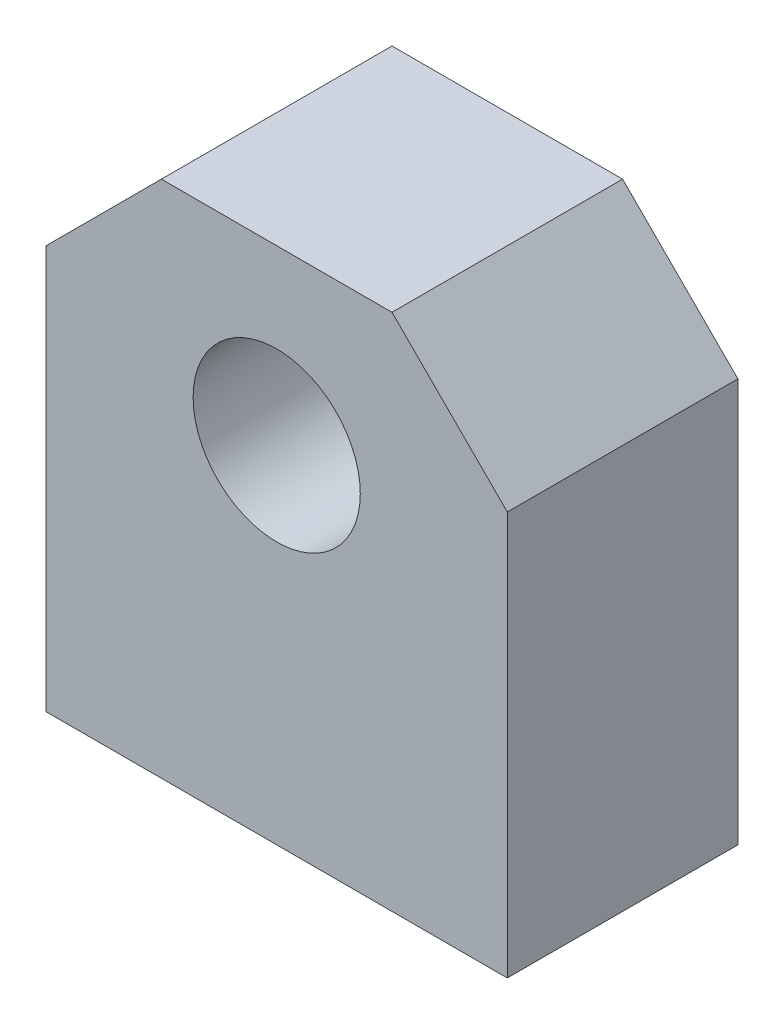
ISO-10303-21;
HEADER;
FILE_DESCRIPTION(('STEP AP214'),'2;1');
FILE_NAME('part.step','',(''),(''),'','','');
FILE_SCHEMA(('AUTOMOTIVE_DESIGN { 1 0 10303 214 1 1 1 1 }'));
ENDSEC;
DATA;
#1=APPLICATION_CONTEXT('core data for automotive mechanical design processes');
#2=APPLICATION_PROTOCOL_DEFINITION('international standard','automotive_design',2000,#1);
#3=PRODUCT_CONTEXT('',#1,'mechanical');
#4=PRODUCT('Part','Part','',(#3));
#5=PRODUCT_RELATED_PRODUCT_CATEGORY('part','',(#4));
#6=PRODUCT_DEFINITION_FORMATION('','',#4);
#7=PRODUCT_DEFINITION_CONTEXT('part definition',#1,'design');
#8=PRODUCT_DEFINITION('design','',#6,#7);
#9=PRODUCT_DEFINITION_SHAPE('','',#8);
#10=(LENGTH_UNIT() NAMED_UNIT(*) SI_UNIT(.MILLI.,.METRE.));
#11=(NAMED_UNIT(*) PLANE_ANGLE_UNIT() SI_UNIT($,.RADIAN.));
#12=(NAMED_UNIT(*) SI_UNIT($,.STERADIAN.) SOLID_ANGLE_UNIT());
#13=UNCERTAINTY_MEASURE_WITH_UNIT(LENGTH_MEASURE(1.E-05),#10,'distance_accuracy_value','');
#14=(GEOMETRIC_REPRESENTATION_CONTEXT(3) GLOBAL_UNCERTAINTY_ASSIGNED_CONTEXT((#13)) GLOBAL_UNIT_ASSIGNED_CONTEXT((#10,
#11,#12)) REPRESENTATION_CONTEXT('',''));
#15=CARTESIAN_POINT('',(0.,0.,0.));
#16=DIRECTION('',(0.,0.,1.));
#17=DIRECTION('',(1.,0.,0.));
#18=AXIS2_PLACEMENT_3D('',#15,#16,#17);
#19=CARTESIAN_POINT('',(-20.,15.,20.));
#20=DIRECTION('',(0.,0.,-1.));
#21=DIRECTION('',(-1.,0.,0.));
#22=AXIS2_PLACEMENT_3D('',#19,#20,#21);
#23=PLANE('',#22);
#24=DIRECTION('',(0.,-1.,0.));
#25=VECTOR('',#24,1.);
#26=CARTESIAN_POINT('',(-20.,-30.,20.));
#27=LINE('',#26,#25);
#28=CARTESIAN_POINT('',(-20.,5.,20.));
#29=VERTEX_POINT('',#28);
#30=CARTESIAN_POINT('',(-20.,-30.,20.));
#31=VERTEX_POINT('',#30);
#32=EDGE_CURVE('E137',#29,#31,#27,.T.);
#33=ORIENTED_EDGE('',*,*,#32,.T.);
#34=DIRECTION('',(1.,0.,0.));
#35=VECTOR('',#34,1.);
#36=CARTESIAN_POINT('',(-20.,-30.,20.));
#37=LINE('',#36,#35);
#38=CARTESIAN_POINT('',(20.,-30.,20.));
#39=VERTEX_POINT('',#38);
#40=EDGE_CURVE('E93',#31,#39,#37,.T.);
#41=ORIENTED_EDGE('',*,*,#40,.T.);
#42=DIRECTION('',(0.,1.,0.));
#43=VECTOR('',#42,1.);
#44=CARTESIAN_POINT('',(20.,-30.,20.));
#45=LINE('',#44,#43);
#46=CARTESIAN_POINT('',(20.,5.,20.));
#47=VERTEX_POINT('',#46);
#48=EDGE_CURVE('E108',#39,#47,#45,.T.);
#49=ORIENTED_EDGE('',*,*,#48,.T.);
#50=DIRECTION('',(-0.707106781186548,0.707106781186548,0.));
#51=VECTOR('',#50,1.);
#52=CARTESIAN_POINT('',(10.,15.,20.));
#53=LINE('',#52,#51);
#54=CARTESIAN_POINT('',(10.,15.,20.));
#55=VERTEX_POINT('',#54);
#56=EDGE_CURVE('E102',#47,#55,#53,.T.);
#57=ORIENTED_EDGE('',*,*,#56,.T.);
#58=DIRECTION('',(-1.,0.,0.));
#59=VECTOR('',#58,1.);
#60=CARTESIAN_POINT('',(-10.,15.,20.));
#61=LINE('',#60,#59);
#62=CARTESIAN_POINT('',(-10.,15.,20.));
#63=VERTEX_POINT('',#62);
#64=EDGE_CURVE('E106',#55,#63,#61,.T.);
#65=ORIENTED_EDGE('',*,*,#64,.T.);
#66=DIRECTION('',(-0.707106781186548,-0.707106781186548,0.));
#67=VECTOR('',#66,1.);
#68=CARTESIAN_POINT('',(-20.,5.,20.));
#69=LINE('',#68,#67);
#70=EDGE_CURVE('E55',#63,#29,#69,.T.);
#71=ORIENTED_EDGE('',*,*,#70,.T.);
#72=EDGE_LOOP('',(#33,#41,#49,#57,#65,#71));
#73=FACE_BOUND('',#72,.T.);
#74=CARTESIAN_POINT('',(0.,0.,20.));
#75=DIRECTION('',(0.,0.,1.));
#76=DIRECTION('',(1.,0.,0.));
#77=AXIS2_PLACEMENT_3D('',#74,#75,#76);
#78=CIRCLE('',#77,7.25);
#79=CARTESIAN_POINT('',(7.25,0.,20.));
#80=VERTEX_POINT('',#79);
#81=EDGE_CURVE('E130',#80,#80,#78,.T.);
#82=ORIENTED_EDGE('',*,*,#81,.F.);
#83=EDGE_LOOP('',(#82));
#84=FACE_BOUND('',#83,.T.);
#85=ADVANCED_FACE('F38',(#73,#84),#23,.F.);
#86=CARTESIAN_POINT('',(-20.,15.,0.));
#87=DIRECTION('',(0.,0.,-1.));
#88=DIRECTION('',(-1.,0.,0.));
#89=AXIS2_PLACEMENT_3D('',#86,#87,#88);
#90=PLANE('',#89);
#91=DIRECTION('',(0.,-1.,0.));
#92=VECTOR('',#91,1.);
#93=CARTESIAN_POINT('',(-20.,-30.,0.));
#94=LINE('',#93,#92);
#95=CARTESIAN_POINT('',(-20.,5.,0.));
#96=VERTEX_POINT('',#95);
#97=CARTESIAN_POINT('',(-20.,-30.,0.));
#98=VERTEX_POINT('',#97);
#99=EDGE_CURVE('E126',#96,#98,#94,.T.);
#100=ORIENTED_EDGE('',*,*,#99,.F.);
#101=DIRECTION('',(-0.707106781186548,-0.707106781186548,0.));
#102=VECTOR('',#101,1.);
#103=CARTESIAN_POINT('',(-20.,5.,0.));
#104=LINE('',#103,#102);
#105=CARTESIAN_POINT('',(-10.,15.,0.));
#106=VERTEX_POINT('',#105);
#107=EDGE_CURVE('E85',#106,#96,#104,.T.);
#108=ORIENTED_EDGE('',*,*,#107,.F.);
#109=DIRECTION('',(-1.,0.,0.));
#110=VECTOR('',#109,1.);
#111=CARTESIAN_POINT('',(-10.,15.,0.));
#112=LINE('',#111,#110);
#113=CARTESIAN_POINT('',(10.,15.,0.));
#114=VERTEX_POINT('',#113);
#115=EDGE_CURVE('E79',#114,#106,#112,.T.);
#116=ORIENTED_EDGE('',*,*,#115,.F.);
#117=DIRECTION('',(-0.707106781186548,0.707106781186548,0.));
#118=VECTOR('',#117,1.);
#119=CARTESIAN_POINT('',(10.,15.,0.));
#120=LINE('',#119,#118);
#121=CARTESIAN_POINT('',(20.,5.,0.));
#122=VERTEX_POINT('',#121);
#123=EDGE_CURVE('E116',#122,#114,#120,.T.);
#124=ORIENTED_EDGE('',*,*,#123,.F.);
#125=DIRECTION('',(0.,1.,0.));
#126=VECTOR('',#125,1.);
#127=CARTESIAN_POINT('',(20.,-30.,0.));
#128=LINE('',#127,#126);
#129=CARTESIAN_POINT('',(20.,-30.,0.));
#130=VERTEX_POINT('',#129);
#131=EDGE_CURVE('E132',#130,#122,#128,.T.);
#132=ORIENTED_EDGE('',*,*,#131,.F.);
#133=DIRECTION('',(1.,0.,0.));
#134=VECTOR('',#133,1.);
#135=CARTESIAN_POINT('',(-20.,-30.,0.));
#136=LINE('',#135,#134);
#137=EDGE_CURVE('E129',#98,#130,#136,.T.);
#138=ORIENTED_EDGE('',*,*,#137,.F.);
#139=EDGE_LOOP('',(#100,#108,#116,#124,#132,#138));
#140=FACE_BOUND('',#139,.T.);
#141=CARTESIAN_POINT('',(0.,0.,0.));
#142=DIRECTION('',(0.,0.,1.));
#143=DIRECTION('',(1.,0.,0.));
#144=AXIS2_PLACEMENT_3D('',#141,#142,#143);
#145=CIRCLE('',#144,7.25);
#146=CARTESIAN_POINT('',(7.25,0.,0.));
#147=VERTEX_POINT('',#146);
#148=EDGE_CURVE('E203',#147,#147,#145,.T.);
#149=ORIENTED_EDGE('',*,*,#148,.T.);
#150=EDGE_LOOP('',(#149));
#151=FACE_BOUND('',#150,.T.);
#152=ADVANCED_FACE('F146',(#140,#151),#90,.T.);
#153=CARTESIAN_POINT('',(-20.,-30.,20.));
#154=DIRECTION('',(1.,0.,0.));
#155=DIRECTION('',(0.,0.,-1.));
#156=AXIS2_PLACEMENT_3D('',#153,#154,#155);
#157=PLANE('',#156);
#158=ORIENTED_EDGE('',*,*,#99,.T.);
#159=DIRECTION('',(0.,0.,-1.));
#160=VECTOR('',#159,1.);
#161=CARTESIAN_POINT('',(-20.,-30.,20.));
#162=LINE('',#161,#160);
#163=EDGE_CURVE('E11',#31,#98,#162,.T.);
#164=ORIENTED_EDGE('',*,*,#163,.F.);
#165=ORIENTED_EDGE('',*,*,#32,.F.);
#166=DIRECTION('',(0.,0.,-1.));
#167=VECTOR('',#166,1.);
#168=CARTESIAN_POINT('',(-20.,5.,20.));
#169=LINE('',#168,#167);
#170=EDGE_CURVE('E122',#29,#96,#169,.T.);
#171=ORIENTED_EDGE('',*,*,#170,.T.);
#172=EDGE_LOOP('',(#158,#164,#165,#171));
#173=FACE_BOUND('',#172,.T.);
#174=ADVANCED_FACE('F40',(#173),#157,.F.);
#175=CARTESIAN_POINT('',(-20.,-30.,20.));
#176=DIRECTION('',(0.,1.,0.));
#177=DIRECTION('',(0.,0.,1.));
#178=AXIS2_PLACEMENT_3D('',#175,#176,#177);
#179=PLANE('',#178);
#180=CARTESIAN_POINT('',(10.,-30.,10.));
#181=DIRECTION('',(0.,-1.,0.));
#182=DIRECTION('',(0.,0.,-1.));
#183=AXIS2_PLACEMENT_3D('',#180,#181,#182);
#184=CIRCLE('',#183,2.5);
#185=CARTESIAN_POINT('',(10.,-30.,7.5));
#186=VERTEX_POINT('',#185);
#187=EDGE_CURVE('E192',#186,#186,#184,.T.);
#188=ORIENTED_EDGE('',*,*,#187,.F.);
#189=EDGE_LOOP('',(#188));
#190=FACE_BOUND('',#189,.T.);
#191=CARTESIAN_POINT('',(-10.,-30.,10.));
#192=DIRECTION('',(0.,-1.,0.));
#193=DIRECTION('',(0.,0.,-1.));
#194=AXIS2_PLACEMENT_3D('',#191,#192,#193);
#195=CIRCLE('',#194,2.5);
#196=CARTESIAN_POINT('',(-10.,-30.,7.5));
#197=VERTEX_POINT('',#196);
#198=EDGE_CURVE('E195',#197,#197,#195,.T.);
#199=ORIENTED_EDGE('',*,*,#198,.F.);
#200=EDGE_LOOP('',(#199));
#201=FACE_BOUND('',#200,.T.);
#202=ORIENTED_EDGE('',*,*,#137,.T.);
#203=DIRECTION('',(0.,0.,-1.));
#204=VECTOR('',#203,1.);
#205=CARTESIAN_POINT('',(20.,-30.,20.));
#206=LINE('',#205,#204);
#207=EDGE_CURVE('E47',#39,#130,#206,.T.);
#208=ORIENTED_EDGE('',*,*,#207,.F.);
#209=ORIENTED_EDGE('',*,*,#40,.F.);
#210=ORIENTED_EDGE('',*,*,#163,.T.);
#211=EDGE_LOOP('',(#202,#208,#209,#210));
#212=FACE_BOUND('',#211,.T.);
#213=ADVANCED_FACE('F217',(#190,#201,#212),#179,.F.);
#214=CARTESIAN_POINT('',(20.,-30.,20.));
#215=DIRECTION('',(-1.,0.,0.));
#216=DIRECTION('',(0.,0.,1.));
#217=AXIS2_PLACEMENT_3D('',#214,#215,#216);
#218=PLANE('',#217);
#219=ORIENTED_EDGE('',*,*,#131,.T.);
#220=DIRECTION('',(0.,0.,-1.));
#221=VECTOR('',#220,1.);
#222=CARTESIAN_POINT('',(20.,5.,20.));
#223=LINE('',#222,#221);
#224=EDGE_CURVE('E117',#47,#122,#223,.T.);
#225=ORIENTED_EDGE('',*,*,#224,.F.);
#226=ORIENTED_EDGE('',*,*,#48,.F.);
#227=ORIENTED_EDGE('',*,*,#207,.T.);
#228=EDGE_LOOP('',(#219,#225,#226,#227));
#229=FACE_BOUND('',#228,.T.);
#230=ADVANCED_FACE('F143',(#229),#218,.F.);
#231=CARTESIAN_POINT('',(10.,15.,20.));
#232=DIRECTION('',(-0.707106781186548,-0.707106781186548,0.));
#233=DIRECTION('',(0.707106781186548,-0.707106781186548,0.));
#234=AXIS2_PLACEMENT_3D('',#231,#232,#233);
#235=PLANE('',#234);
#236=ORIENTED_EDGE('',*,*,#123,.T.);
#237=DIRECTION('',(0.,0.,-1.));
#238=VECTOR('',#237,1.);
#239=CARTESIAN_POINT('',(10.,15.,20.));
#240=LINE('',#239,#238);
#241=EDGE_CURVE('E113',#55,#114,#240,.T.);
#242=ORIENTED_EDGE('',*,*,#241,.F.);
#243=ORIENTED_EDGE('',*,*,#56,.F.);
#244=ORIENTED_EDGE('',*,*,#224,.T.);
#245=EDGE_LOOP('',(#236,#242,#243,#244));
#246=FACE_BOUND('',#245,.T.);
#247=ADVANCED_FACE('F114',(#246),#235,.F.);
#248=CARTESIAN_POINT('',(-10.,15.,20.));
#249=DIRECTION('',(0.,-1.,0.));
#250=DIRECTION('',(0.,0.,-1.));
#251=AXIS2_PLACEMENT_3D('',#248,#249,#250);
#252=PLANE('',#251);
#253=ORIENTED_EDGE('',*,*,#115,.T.);
#254=DIRECTION('',(0.,0.,-1.));
#255=VECTOR('',#254,1.);
#256=CARTESIAN_POINT('',(-10.,15.,20.));
#257=LINE('',#256,#255);
#258=EDGE_CURVE('E118',#63,#106,#257,.T.);
#259=ORIENTED_EDGE('',*,*,#258,.F.);
#260=ORIENTED_EDGE('',*,*,#64,.F.);
#261=ORIENTED_EDGE('',*,*,#241,.T.);
#262=EDGE_LOOP('',(#253,#259,#260,#261));
#263=FACE_BOUND('',#262,.T.);
#264=ADVANCED_FACE('F120',(#263),#252,.F.);
#265=CARTESIAN_POINT('',(-20.,5.,20.));
#266=DIRECTION('',(0.707106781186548,-0.707106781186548,0.));
#267=DIRECTION('',(0.707106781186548,0.707106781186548,0.));
#268=AXIS2_PLACEMENT_3D('',#265,#266,#267);
#269=PLANE('',#268);
#270=ORIENTED_EDGE('',*,*,#107,.T.);
#271=ORIENTED_EDGE('',*,*,#170,.F.);
#272=ORIENTED_EDGE('',*,*,#70,.F.);
#273=ORIENTED_EDGE('',*,*,#258,.T.);
#274=EDGE_LOOP('',(#270,#271,#272,#273));
#275=FACE_BOUND('',#274,.T.);
#276=ADVANCED_FACE('F151',(#275),#269,.F.);
#277=CARTESIAN_POINT('',(0.,0.,20.));
#278=DIRECTION('',(0.,0.,-1.));
#279=DIRECTION('',(-1.,0.,0.));
#280=AXIS2_PLACEMENT_3D('',#277,#278,#279);
#281=CYLINDRICAL_SURFACE('',#280,7.25);
#282=ORIENTED_EDGE('',*,*,#81,.T.);
#283=EDGE_LOOP('',(#282));
#284=FACE_BOUND('',#283,.T.);
#285=ORIENTED_EDGE('',*,*,#148,.F.);
#286=EDGE_LOOP('',(#285));
#287=FACE_BOUND('',#286,.T.);
#288=ADVANCED_FACE('F153',(#284,#287),#281,.F.);
#289=CARTESIAN_POINT('',(-10.,-5.,10.));
#290=DIRECTION('',(0.,-1.,0.));
#291=DIRECTION('',(0.,0.,-1.));
#292=AXIS2_PLACEMENT_3D('',#289,#290,#291);
#293=CONICAL_SURFACE('',#292,2.49999999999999,1.02974425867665);
#294=CARTESIAN_POINT('',(-10.,-3.4978484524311,10.));
#295=VERTEX_POINT('',#294);
#296=VERTEX_LOOP('',#295);
#297=FACE_BOUND('',#296,.T.);
#298=CARTESIAN_POINT('',(-10.,-5.,10.));
#299=DIRECTION('',(0.,-1.,0.));
#300=DIRECTION('',(0.,0.,-1.));
#301=AXIS2_PLACEMENT_3D('',#298,#299,#300);
#302=CIRCLE('',#301,2.49999999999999);
#303=CARTESIAN_POINT('',(-10.,-5.,7.50000000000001));
#304=VERTEX_POINT('',#303);
#305=EDGE_CURVE('E200',#304,#304,#302,.T.);
#306=ORIENTED_EDGE('',*,*,#305,.T.);
#307=EDGE_LOOP('',(#306));
#308=FACE_BOUND('',#307,.T.);
#309=ADVANCED_FACE('F159',(#297,#308),#293,.F.);
#310=CARTESIAN_POINT('',(-10.,-30.,10.));
#311=DIRECTION('',(0.,-1.,0.));
#312=DIRECTION('',(0.,0.,-1.));
#313=AXIS2_PLACEMENT_3D('',#310,#311,#312);
#314=CYLINDRICAL_SURFACE('',#313,2.5);
#315=ORIENTED_EDGE('',*,*,#305,.F.);
#316=EDGE_LOOP('',(#315));
#317=FACE_BOUND('',#316,.T.);
#318=ORIENTED_EDGE('',*,*,#198,.T.);
#319=EDGE_LOOP('',(#318));
#320=FACE_BOUND('',#319,.T.);
#321=ADVANCED_FACE('F172',(#317,#320),#314,.F.);
#322=CARTESIAN_POINT('',(10.,-5.,10.));
#323=DIRECTION('',(0.,-1.,0.));
#324=DIRECTION('',(0.,0.,-1.));
#325=AXIS2_PLACEMENT_3D('',#322,#323,#324);
#326=CONICAL_SURFACE('',#325,2.49999999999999,1.02974425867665);
#327=CARTESIAN_POINT('',(9.99999999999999,-3.4978484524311,10.));
#328=VERTEX_POINT('',#327);
#329=VERTEX_LOOP('',#328);
#330=FACE_BOUND('',#329,.T.);
#331=CARTESIAN_POINT('',(10.,-5.,10.));
#332=DIRECTION('',(0.,-1.,0.));
#333=DIRECTION('',(0.,0.,-1.));
#334=AXIS2_PLACEMENT_3D('',#331,#332,#333);
#335=CIRCLE('',#334,2.49999999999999);
#336=CARTESIAN_POINT('',(10.,-5.,7.50000000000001));
#337=VERTEX_POINT('',#336);
#338=EDGE_CURVE('E189',#337,#337,#335,.T.);
#339=ORIENTED_EDGE('',*,*,#338,.T.);
#340=EDGE_LOOP('',(#339));
#341=FACE_BOUND('',#340,.T.);
#342=ADVANCED_FACE('F176',(#330,#341),#326,.F.);
#343=CARTESIAN_POINT('',(10.,-30.,10.));
#344=DIRECTION('',(0.,-1.,0.));
#345=DIRECTION('',(0.,0.,-1.));
#346=AXIS2_PLACEMENT_3D('',#343,#344,#345);
#347=CYLINDRICAL_SURFACE('',#346,2.5);
#348=ORIENTED_EDGE('',*,*,#338,.F.);
#349=EDGE_LOOP('',(#348));
#350=FACE_BOUND('',#349,.T.);
#351=ORIENTED_EDGE('',*,*,#187,.T.);
#352=EDGE_LOOP('',(#351));
#353=FACE_BOUND('',#352,.T.);
#354=ADVANCED_FACE('F180',(#350,#353),#347,.F.);
#355=CLOSED_SHELL('',(#85,#152,#174,#213,#230,#247,#264,#276,#288,#309,#321,#342,#354));
#356=MANIFOLD_SOLID_BREP('B2',#355);
#357=ADVANCED_BREP_SHAPE_REPRESENTATION('',(#18,#356),#14);
#358=SHAPE_DEFINITION_REPRESENTATION(#9,#357);
ENDSEC;
END-ISO-10303-21;
